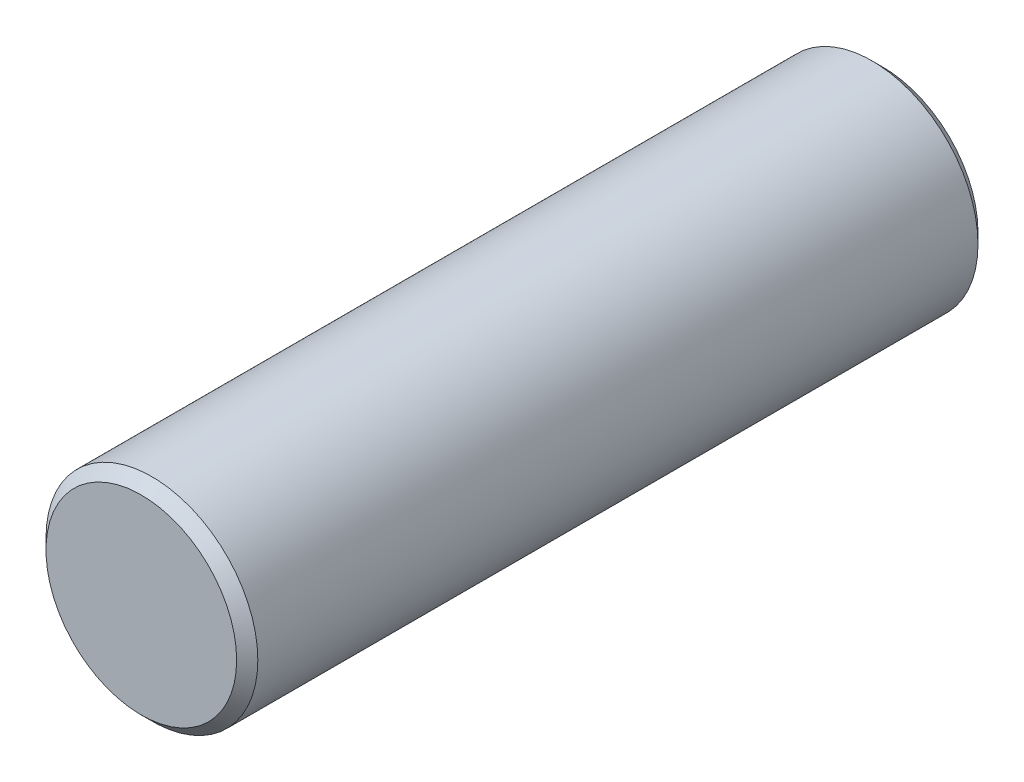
from build123d import *

# Parameters (mm, degrees)
ESQUISSE1_R        = 2
BOSS_EXTRU_1_DEPTH = 14
CHANFREIN1_SIZE    = 0.2


with BuildPart() as part:
    # Esquisse1 → Boss.-Extru.1 (new body)
    with BuildSketch(Plane.XY):
        Circle(ESQUISSE1_R)
    extrude(amount=BOSS_EXTRU_1_DEPTH)

    # Chanfrein1
    chanfrein1_edges = [part.edges().sort_by_distance(p)[0] for p in [
        (-2, 0, 0),
        (-2, 0, 14),
    ]]
    chamfer(chanfrein1_edges, length=CHANFREIN1_SIZE)


solid = part.part
